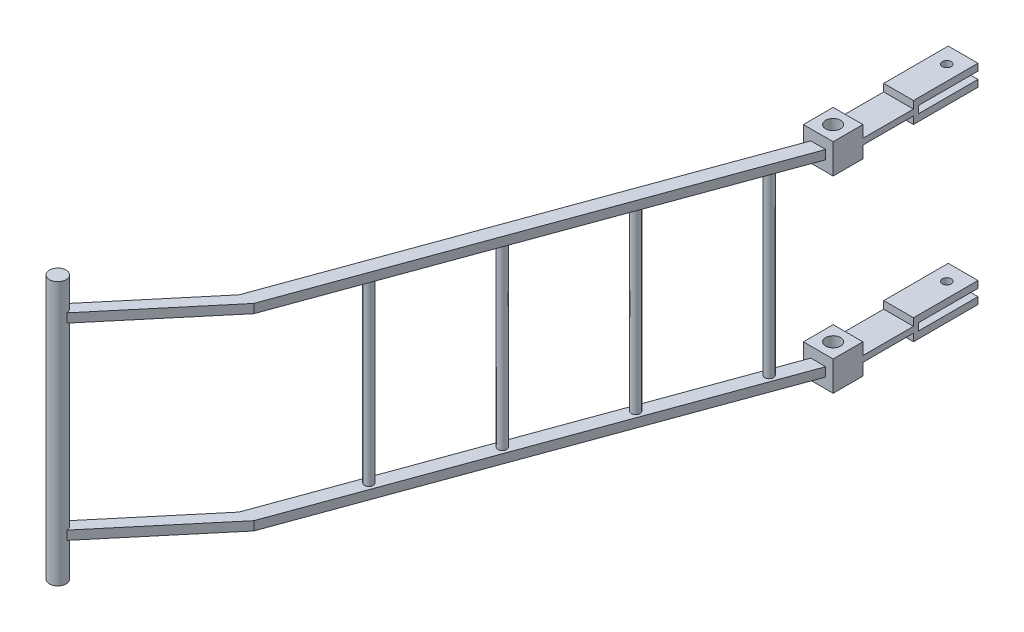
from build123d import *

# Parameters (mm, degrees)
SKETCH1_W               = 10
SKETCH1_H               = 10
BOSS_EXTRUDE1_DEPTH     = 10
SKETCH2_R               = 2.5
CUT_EXTRUDE1_DEPTH      = 10
SKETCH3_W               = 10
SKETCH3_H               = 2
BOSS_EXTRUDE2_DEPTH     = 17
SKETCH4_W               = 10
SKETCH4_H               = 7
BOSS_EXTRUDE3_DEPTH     = 1.7
SKETCH5_W               = 10
SKETCH5_H               = 2.3
BOSS_EXTRUDE4_DEPTH     = 20
SKETCH6_R               = 1.5
CUT_EXTRUDE2_DEPTH      = 20
SKETCH10_W              = 5
SKETCH10_H              = 3
SKETCH12_W              = 5
SKETCH12_H              = 3
SKETCH14_R              = 2.8
MIRROR4_COPY_1_SKETCH_W = 5
MIRROR4_COPY_1_SKETCH_H = 3
MIRROR4_COPY_2_SKETCH_W = 5
MIRROR4_COPY_2_SKETCH_H = 3
SKETCH15_R              = 1.45
LPATTERN1_COUNT         = 4
LPATTERN1_PITCH         = 35


with BuildPart() as part:
    # Sketch1 → Boss-Extrude1 (new body)
    with BuildSketch(Plane.XY):
        with Locations((5, 5)):
            Rectangle(SKETCH1_W, SKETCH1_H)
    boss_extrude1 = extrude(amount=BOSS_EXTRUDE1_DEPTH)

    # Sketch2 → Cut-Extrude1 (cut)
    with BuildSketch(Plane(origin=(0, 10, 0), x_dir=(1, 0, 0), z_dir=(0, 1, 0))):
        with Locations(Location((5, -5, 0), (0, 0, 270))):
            Circle(SKETCH2_R)
    cut_extrude1 = extrude(amount=-CUT_EXTRUDE1_DEPTH, mode=Mode.SUBTRACT)

    # Sketch3 → Boss-Extrude2 (add)
    with BuildSketch(Plane(origin=(0, 0, 0), x_dir=(-1, 0, 0), z_dir=(0, 0, -1))):
        with Locations((-5, 5)):
            Rectangle(SKETCH3_W, SKETCH3_H)
    boss_extrude2 = extrude(amount=BOSS_EXTRUDE2_DEPTH)

    # Sketch4 → Boss-Extrude3 (add)
    with BuildSketch(Plane(origin=(0, 0, -17), x_dir=(-1, 0, 0), z_dir=(0, 0, -1))):
        with Locations((-5, 5)):
            Rectangle(SKETCH4_W, SKETCH4_H)
    boss_extrude3 = extrude(amount=BOSS_EXTRUDE3_DEPTH)

    # Sketch5 → Boss-Extrude4 (add)
    with BuildSketch(Plane(origin=(0, 0, -18.7), x_dir=(-1, 0, 0), z_dir=(0, 0, -1))):
        with Locations((-5, 2.65)):
            Rectangle(SKETCH5_W, SKETCH5_H)
        with Locations((-5, 7.35)):
            Rectangle(SKETCH5_W, SKETCH5_H)
    boss_extrude4 = extrude(amount=BOSS_EXTRUDE4_DEPTH)

    # Sketch6 → Cut-Extrude2 (cut)
    with BuildSketch(Plane(origin=(0, 8.5, 0), x_dir=(1, 0, 0), z_dir=(0, 1, 0))):
        with Locations(Location((5, 33.2, 0), (0, 0, 270))):
            Circle(SKETCH6_R)
    cut_extrude2 = extrude(amount=-CUT_EXTRUDE2_DEPTH, mode=Mode.SUBTRACT)

    # Sweep1: sweep along a path in Sketch7
    with BuildLine(Plane(origin=(0, 5, 0), x_dir=(-1, 0, 0), z_dir=(0, 1, 0))) as sweep1_path:
        Line((-5, 10), (46.303021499, 150.953893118))
    # Sketch10 → Sweep1 (sweep)
    with BuildSketch(Plane.XY.offset(10)):
        with Locations((5, 5)):
            Rectangle(SKETCH10_W, SKETCH10_H)
    sweep1 = sweep(path=sweep1_path.line)

    # Sweep2: sweep along a path in Sketch11
    with BuildLine(Plane(origin=(0, 5, 0), x_dir=(-1, 0, 0), z_dir=(0, 1, 0))) as sweep2_path:
        Line((46.303021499, 150.953893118), (75.228463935, 185.425893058))
    # Sketch12 → Sweep2 (sweep)
    with BuildSketch(Plane.XY.offset(150.953893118)):
        with Locations((-46.303021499, 5)):
            Rectangle(SKETCH12_W, SKETCH12_H)
    sweep2 = sweep(path=sweep2_path.line)

    # Sweep3: sweep along a path in Sketch13
    with BuildLine(Plane.XY.offset(185.425893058)) as sweep3_path:
        Line((-75.228463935, 79.6), (-75.228463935, 65.6))
        Line((-75.228463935, 65.6), (-75.228463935, 5))
        Line((-75.228463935, 5), (-75.228463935, -9))
    # Sketch14 → Sweep3 (sweep)
    with BuildSketch(Plane(origin=(-75.228463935, -9, 185.425893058), x_dir=(1, 0, 0), z_dir=(0, -1, 0))):
        Circle(SKETCH14_R)
    sweep(path=sweep3_path.line)

    # Mirror2: Sweep2 across plane
    add(sweep2.mirror(Plane.ZX.offset(36.625)))

    # Mirror3: Sweep1 across plane
    add(sweep1.mirror(Plane.ZX.offset(36.625)))

    # Mirror4: Boss-Extrude1, Cut-Extrude1 across plane
    add(boss_extrude1.mirror(Plane.ZX.offset(36.625)))
    add(cut_extrude1.mirror(Plane.ZX.offset(36.625)), mode=Mode.SUBTRACT)

    # Mirror4 copy 1: sweep along a path in Mirror4 copy 1 path
    with BuildLine(Plane(origin=(0, 5, 0), x_dir=(-1, 0, 0), z_dir=(0, 1, 0))) as mirror4_copy_1_path:
        Line((-5, 10), (46.303021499, 150.953893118))
    # Mirror4 copy 1 sketch → Mirror4 copy 1 (sweep)
    with BuildSketch(Plane.XY.offset(10)):
        with Locations((5, 5)):
            Rectangle(MIRROR4_COPY_1_SKETCH_W, MIRROR4_COPY_1_SKETCH_H)
    sweep(path=mirror4_copy_1_path.line)

    # Mirror4 copy 2: sweep along a path in Mirror4 copy 2 path
    with BuildLine(Plane(origin=(0, 68.25, 0), x_dir=(-1, 0, 0), z_dir=(0, -1, 0))) as mirror4_copy_2_path:
        Line((-5, -10), (46.303021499, -150.953893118))
    # Mirror4 copy 2 sketch → Mirror4 copy 2 (sweep)
    with BuildSketch(Plane(origin=(0, 73.25, 10), x_dir=(1, 0, 0), z_dir=(0, 0, 1))):
        with Locations((5, -5)):
            Rectangle(MIRROR4_COPY_2_SKETCH_W, MIRROR4_COPY_2_SKETCH_H)
    sweep(path=mirror4_copy_2_path.line)

    # Mirror5: Boss-Extrude2, Boss-Extrude3, Boss-Extrude4, Cut-Extrude2 across plane
    add(boss_extrude2.mirror(Plane.ZX.offset(36.625)))
    add(boss_extrude3.mirror(Plane.ZX.offset(36.625)))
    add(boss_extrude4.mirror(Plane.ZX.offset(36.625)))
    add(cut_extrude2.mirror(Plane.ZX.offset(36.625)), mode=Mode.SUBTRACT)

    # Sweep4: sweep along a path in Sketch16
    with BuildLine(Plane(origin=(7.497153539, 0, 2.72874073), x_dir=(0.3420201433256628, 0, -0.9396926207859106), z_dir=(0.9396926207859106, 0, 0.34202014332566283))) as sweep4_path:
        Line((-20.495789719, 66.75), (-20.495789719, 5.75))
    # Sketch15 → Sweep4 (sweep)
    with BuildSketch(Plane.XZ.offset(-66.75)):
        with Locations((0.487180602, 21.988483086)):
            Circle(SKETCH15_R)
    sweep4 = sweep(path=sweep4_path.line)

    # LPattern1: Sweep4 ×4
    with Locations(*[Vector(-0.3420201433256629, 0, 0.9396926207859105) * (i * LPATTERN1_PITCH) for i in range(1, LPATTERN1_COUNT)]):
        add(sweep4)


solid = part.part
